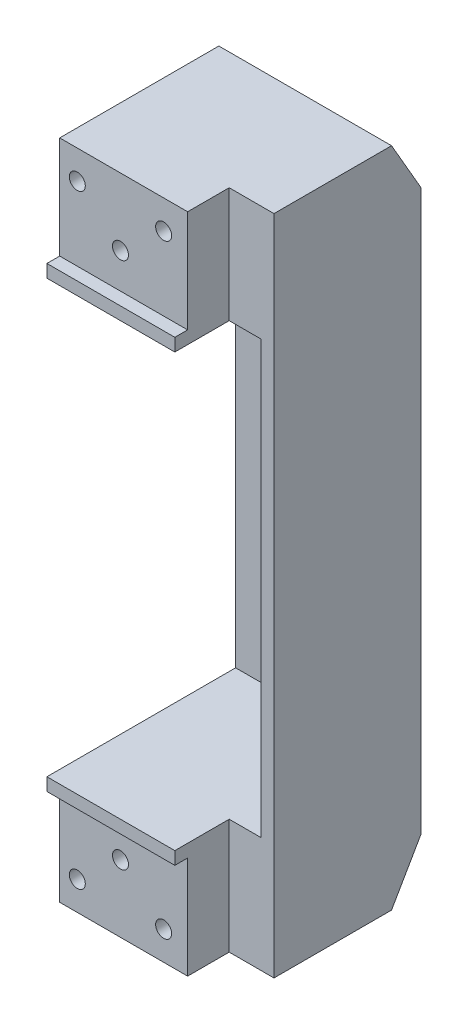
from build123d import *

# Parameters (mm, degrees)
EXTRUDE_1_DEPTH = 32
EXTRUDE_2_DEPTH = 4
EXTRUDE_3_DEPTH = 135
M6X1_01_D       = 5
M6X1_01_DEPTH   = 18
M6X1_01_TIP     = 1.502151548
EXTRUDE_4_DEPTH = 32
CHAMFER_1_SIZE  = 16
CHAMFER_1_SIZE2 = 9.237604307
M6X1_02_D       = 5
M6X1_02_DEPTH   = 20
M6X1_02_TIP     = 1.502151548


with BuildPart() as part:
    # Sketch 1 → Extrude 1 (new body)
    with BuildSketch(Plane(origin=(0, 0, 0), x_dir=(1, 0, 0), z_dir=(0, 1, 0))):
        Polygon((54, 13), (40, 13), (40, 0), (0, 0), (0, 59), (54, 59), align=None)
    extrude(amount=-EXTRUDE_1_DEPTH)

    # Sketch 2 → Extrude 2 (add)
    with BuildSketch(Plane.XZ.offset(32)):
        Polygon((54, -59), (54, -13), (40, -13), (40, 4), (0, 4), (0, -59), align=None)
    extrude_2 = extrude(amount=EXTRUDE_2_DEPTH)

    # Sketch 3 → Extrude 3 (add)
    with BuildSketch(Plane.XZ.offset(36)):
        Polygon((0, -55), (50, -55), (50, -13), (54, -13), (54, -59), (0, -59), align=None)
    extrude(amount=EXTRUDE_3_DEPTH)

    # M6x1.01
    with Locations(Plane.XY):
        with Locations((5.5, -9), (32.5, -9), (19, -21)):
            Hole(M6X1_01_D / 2, depth=M6X1_01_DEPTH)
            with Locations((0, 0, -(M6X1_01_DEPTH + M6X1_01_TIP / 2))):  # 118° drill point
                Cone(0, M6X1_01_D / 2, M6X1_01_TIP, mode=Mode.SUBTRACT)

    # Mirror 2: Extrude 2 across plane
    add(extrude_2.mirror(Plane(origin=(0, -103.5, 0), x_dir=(0, 0, 1), z_dir=(0, -1, 0))))

    # Sketch 4 → Extrude 4 (add)
    with BuildSketch(Plane.XZ.offset(175)):
        Polygon((0, 0), (40, 0), (40, -13), (54, -13), (54, -59), (0, -59), align=None)
    extrude(amount=EXTRUDE_4_DEPTH)

    # Chamfer 1
    chamfer_1_edges = [part.edges().sort_by_distance(p)[0] for p in [
        (27, 0, -59),
        (27, -207, -59),
    ]]
    chamfer_1_side = [part.faces().sort_by_distance(p)[0] for p in [
        (27, -103.5, -59),
    ]]
    chamfer(chamfer_1_edges, length=CHAMFER_1_SIZE, length2=CHAMFER_1_SIZE2, reference=chamfer_1_side[0])

    # M6x1.02
    with Locations(Plane.XY):
        with Locations((32.5, -198), (5.5, -198), (19, -186)):
            Hole(M6X1_02_D / 2, depth=M6X1_02_DEPTH)
            with Locations((0, 0, -(M6X1_02_DEPTH + M6X1_02_TIP / 2))):  # 118° drill point
                Cone(0, M6X1_02_D / 2, M6X1_02_TIP, mode=Mode.SUBTRACT)


solid = part.part
